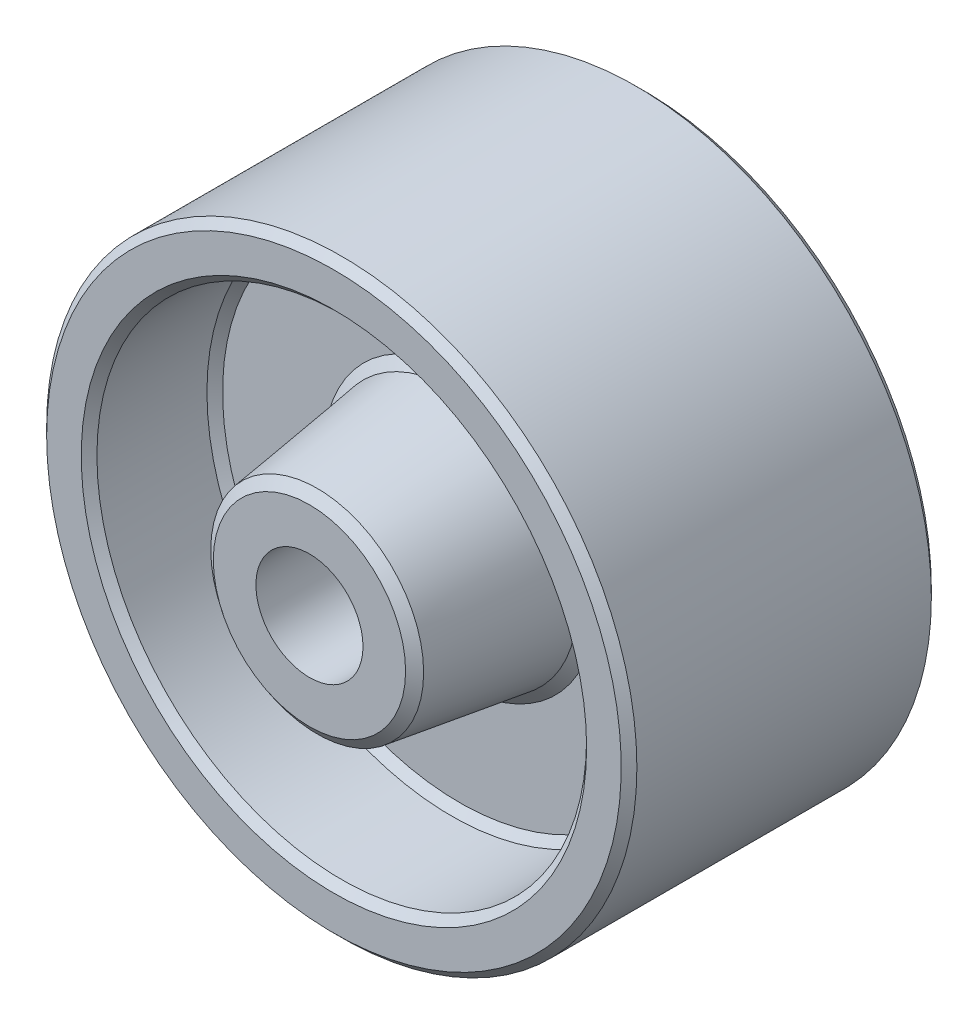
ISO-10303-21;
HEADER;
FILE_DESCRIPTION(('STEP AP214'),'2;1');
FILE_NAME('part.step','',(''),(''),'','','');
FILE_SCHEMA(('AUTOMOTIVE_DESIGN { 1 0 10303 214 1 1 1 1 }'));
ENDSEC;
DATA;
#1=APPLICATION_CONTEXT('core data for automotive mechanical design processes');
#2=APPLICATION_PROTOCOL_DEFINITION('international standard','automotive_design',2000,#1);
#3=PRODUCT_CONTEXT('',#1,'mechanical');
#4=PRODUCT('Part','Part','',(#3));
#5=PRODUCT_RELATED_PRODUCT_CATEGORY('part','',(#4));
#6=PRODUCT_DEFINITION_FORMATION('','',#4);
#7=PRODUCT_DEFINITION_CONTEXT('part definition',#1,'design');
#8=PRODUCT_DEFINITION('design','',#6,#7);
#9=PRODUCT_DEFINITION_SHAPE('','',#8);
#10=(LENGTH_UNIT() NAMED_UNIT(*) SI_UNIT(.MILLI.,.METRE.));
#11=(NAMED_UNIT(*) PLANE_ANGLE_UNIT() SI_UNIT($,.RADIAN.));
#12=(NAMED_UNIT(*) SI_UNIT($,.STERADIAN.) SOLID_ANGLE_UNIT());
#13=UNCERTAINTY_MEASURE_WITH_UNIT(LENGTH_MEASURE(1.E-05),#10,'distance_accuracy_value','');
#14=(GEOMETRIC_REPRESENTATION_CONTEXT(3) GLOBAL_UNCERTAINTY_ASSIGNED_CONTEXT((#13)) GLOBAL_UNIT_ASSIGNED_CONTEXT((#10,
#11,#12)) REPRESENTATION_CONTEXT('',''));
#15=CARTESIAN_POINT('',(0.,0.,0.));
#16=DIRECTION('',(0.,0.,1.));
#17=DIRECTION('',(1.,0.,0.));
#18=AXIS2_PLACEMENT_3D('',#15,#16,#17);
#19=CARTESIAN_POINT('',(0.,0.,2.8575));
#20=DIRECTION('',(0.,0.,1.));
#21=DIRECTION('',(1.,0.,0.));
#22=AXIS2_PLACEMENT_3D('',#19,#20,#21);
#23=PLANE('',#22);
#24=CARTESIAN_POINT('',(0.,0.,2.8575));
#25=DIRECTION('',(0.,0.,1.));
#26=DIRECTION('',(1.,0.,0.));
#27=AXIS2_PLACEMENT_3D('',#24,#25,#26);
#28=CIRCLE('',#27,23.0505);
#29=CARTESIAN_POINT('',(23.0505,0.,2.8575));
#30=VERTEX_POINT('',#29);
#31=EDGE_CURVE('E70',#30,#30,#28,.T.);
#32=ORIENTED_EDGE('',*,*,#31,.T.);
#33=EDGE_LOOP('',(#32));
#34=FACE_BOUND('',#33,.T.);
#35=CARTESIAN_POINT('',(0.,0.,2.8575));
#36=DIRECTION('',(0.,0.,1.));
#37=DIRECTION('',(1.,0.,0.));
#38=AXIS2_PLACEMENT_3D('',#35,#36,#37);
#39=CIRCLE('',#38,13.1937218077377);
#40=CARTESIAN_POINT('',(13.1937218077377,0.,2.8575));
#41=VERTEX_POINT('',#40);
#42=EDGE_CURVE('E73',#41,#41,#39,.F.);
#43=ORIENTED_EDGE('',*,*,#42,.T.);
#44=EDGE_LOOP('',(#43));
#45=FACE_BOUND('',#44,.T.);
#46=ADVANCED_FACE('F29',(#34,#45),#23,.T.);
#47=CARTESIAN_POINT('',(0.,0.,15.08125));
#48=DIRECTION('',(0.,0.,-1.));
#49=DIRECTION('',(-1.,0.,0.));
#50=AXIS2_PLACEMENT_3D('',#47,#48,#49);
#51=CYLINDRICAL_SURFACE('',#50,23.8125);
#52=CARTESIAN_POINT('',(0.,0.,-3.6195));
#53=DIRECTION('',(0.,0.,1.));
#54=DIRECTION('',(1.,0.,0.));
#55=AXIS2_PLACEMENT_3D('',#52,#53,#54);
#56=CIRCLE('',#55,23.8125);
#57=CARTESIAN_POINT('',(-23.8125,0.,-3.6195));
#58=VERTEX_POINT('',#57);
#59=EDGE_CURVE('E36',#58,#58,#56,.T.);
#60=CARTESIAN_POINT('',(0.,0.,-14.31925));
#61=DIRECTION('',(0.,0.,1.));
#62=DIRECTION('',(1.,0.,0.));
#63=AXIS2_PLACEMENT_3D('',#60,#61,#62);
#64=CIRCLE('',#63,23.8125);
#65=CARTESIAN_POINT('',(-23.8125,0.,-14.31925));
#66=VERTEX_POINT('',#65);
#67=EDGE_CURVE('E40',#66,#66,#64,.F.);
#68=CARTESIAN_POINT('',(-23.8125,0.,-3.6195));
#69=CARTESIAN_POINT('',(-23.8125,0.,-3.73095572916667));
#70=CARTESIAN_POINT('',(-23.8125,0.,-3.84241145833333));
#71=CARTESIAN_POINT('',(-23.8125,0.,-4.06532291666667));
#72=CARTESIAN_POINT('',(-23.8125,0.,-4.17677864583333));
#73=CARTESIAN_POINT('',(-23.8125,0.,-4.39969010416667));
#74=CARTESIAN_POINT('',(-23.8125,0.,-4.51114583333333));
#75=CARTESIAN_POINT('',(-23.8125,0.,-4.73405729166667));
#76=CARTESIAN_POINT('',(-23.8125,0.,-4.84551302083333));
#77=CARTESIAN_POINT('',(-23.8125,0.,-5.06842447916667));
#78=CARTESIAN_POINT('',(-23.8125,0.,-5.17988020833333));
#79=CARTESIAN_POINT('',(-23.8125,0.,-5.40279166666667));
#80=CARTESIAN_POINT('',(-23.8125,0.,-5.51424739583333));
#81=CARTESIAN_POINT('',(-23.8125,0.,-5.73715885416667));
#82=CARTESIAN_POINT('',(-23.8125,0.,-5.84861458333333));
#83=CARTESIAN_POINT('',(-23.8125,0.,-6.07152604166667));
#84=CARTESIAN_POINT('',(-23.8125,0.,-6.18298177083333));
#85=CARTESIAN_POINT('',(-23.8125,0.,-6.40589322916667));
#86=CARTESIAN_POINT('',(-23.8125,0.,-6.51734895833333));
#87=CARTESIAN_POINT('',(-23.8125,0.,-6.74026041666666));
#88=CARTESIAN_POINT('',(-23.8125,0.,-6.85171614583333));
#89=CARTESIAN_POINT('',(-23.8125,0.,-7.07462760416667));
#90=CARTESIAN_POINT('',(-23.8125,0.,-7.18608333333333));
#91=CARTESIAN_POINT('',(-23.8125,0.,-7.40899479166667));
#92=CARTESIAN_POINT('',(-23.8125,0.,-7.52045052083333));
#93=CARTESIAN_POINT('',(-23.8125,0.,-7.74336197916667));
#94=CARTESIAN_POINT('',(-23.8125,0.,-7.85481770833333));
#95=CARTESIAN_POINT('',(-23.8125,0.,-8.07772916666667));
#96=CARTESIAN_POINT('',(-23.8125,0.,-8.18918489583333));
#97=CARTESIAN_POINT('',(-23.8125,0.,-8.41209635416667));
#98=CARTESIAN_POINT('',(-23.8125,0.,-8.52355208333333));
#99=CARTESIAN_POINT('',(-23.8125,0.,-8.74646354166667));
#100=CARTESIAN_POINT('',(-23.8125,0.,-8.85791927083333));
#101=CARTESIAN_POINT('',(-23.8125,0.,-9.08083072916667));
#102=CARTESIAN_POINT('',(-23.8125,0.,-9.19228645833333));
#103=CARTESIAN_POINT('',(-23.8125,0.,-9.41519791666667));
#104=CARTESIAN_POINT('',(-23.8125,0.,-9.52665364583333));
#105=CARTESIAN_POINT('',(-23.8125,0.,-9.74956510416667));
#106=CARTESIAN_POINT('',(-23.8125,0.,-9.86102083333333));
#107=CARTESIAN_POINT('',(-23.8125,0.,-10.0839322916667));
#108=CARTESIAN_POINT('',(-23.8125,0.,-10.1953880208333));
#109=CARTESIAN_POINT('',(-23.8125,0.,-10.4182994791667));
#110=CARTESIAN_POINT('',(-23.8125,0.,-10.5297552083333));
#111=CARTESIAN_POINT('',(-23.8125,0.,-10.7526666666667));
#112=CARTESIAN_POINT('',(-23.8125,0.,-10.8641223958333));
#113=CARTESIAN_POINT('',(-23.8125,0.,-11.0870338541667));
#114=CARTESIAN_POINT('',(-23.8125,0.,-11.1984895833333));
#115=CARTESIAN_POINT('',(-23.8125,0.,-11.4214010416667));
#116=CARTESIAN_POINT('',(-23.8125,0.,-11.5328567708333));
#117=CARTESIAN_POINT('',(-23.8125,0.,-11.7557682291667));
#118=CARTESIAN_POINT('',(-23.8125,0.,-11.8672239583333));
#119=CARTESIAN_POINT('',(-23.8125,0.,-12.0901354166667));
#120=CARTESIAN_POINT('',(-23.8125,0.,-12.2015911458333));
#121=CARTESIAN_POINT('',(-23.8125,0.,-12.4245026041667));
#122=CARTESIAN_POINT('',(-23.8125,0.,-12.5359583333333));
#123=CARTESIAN_POINT('',(-23.8125,0.,-12.7588697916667));
#124=CARTESIAN_POINT('',(-23.8125,0.,-12.8703255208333));
#125=CARTESIAN_POINT('',(-23.8125,0.,-13.0932369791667));
#126=CARTESIAN_POINT('',(-23.8125,0.,-13.2046927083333));
#127=CARTESIAN_POINT('',(-23.8125,0.,-13.4276041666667));
#128=CARTESIAN_POINT('',(-23.8125,0.,-13.5390598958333));
#129=CARTESIAN_POINT('',(-23.8125,0.,-13.7619713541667));
#130=CARTESIAN_POINT('',(-23.8125,0.,-13.8734270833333));
#131=CARTESIAN_POINT('',(-23.8125,0.,-14.0963385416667));
#132=CARTESIAN_POINT('',(-23.8125,0.,-14.2077942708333));
#133=CARTESIAN_POINT('',(-23.8125,0.,-14.31925));
#134=B_SPLINE_CURVE_WITH_KNOTS('',3,(#68,#69,#70,#71,#72,#73,#74,#75,#76,#77,#78,#79,#80,#81,
#82,#83,#84,#85,#86,#87,#88,#89,#90,#91,#92,#93,#94,#95,#96,#97,#98,#99,#100,#101,#102,#103,
#104,#105,#106,#107,#108,#109,#110,#111,#112,#113,#114,#115,#116,#117,#118,#119,#120,#121,#122,
#123,#124,#125,#126,#127,#128,#129,#130,#131,#132,#133),.UNSPECIFIED.,.F.,.F.,(4,2,2,2,2,2,2,2,
2,2,2,2,2,2,2,2,2,2,2,2,2,2,2,2,2,2,2,2,2,2,2,2,4),(0.,0.3343671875,0.668734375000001,
1.0031015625,1.33746875,1.6718359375,2.006203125,2.3405703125,2.6749375,3.0093046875,
3.343671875,3.6780390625,4.01240625,4.3467734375,4.681140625,5.0155078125,5.349875,5.6842421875,
6.018609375,6.3529765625,6.68734375,7.0217109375,7.356078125,7.6904453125,8.0248125,
8.3591796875,8.693546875,9.0279140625,9.36228125,9.6966484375,10.031015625,10.3653828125,
10.69975),.UNSPECIFIED.);
#135=EDGE_CURVE('BSEAM124',#58,#66,#134,.T.);
#136=ORIENTED_EDGE('',*,*,#59,.T.);
#137=ORIENTED_EDGE('',*,*,#67,.T.);
#138=ORIENTED_EDGE('',*,*,#135,.T.);
#139=ORIENTED_EDGE('',*,*,#135,.F.);
#140=EDGE_LOOP('',(#136,#138,#137,#139));
#141=FACE_BOUND('',#140,.T.);
#142=ADVANCED_FACE('F124',(#141),#51,.F.);
#143=CARTESIAN_POINT('',(0.,0.,14.31925));
#144=DIRECTION('',(0.,0.,1.));
#145=DIRECTION('',(1.,0.,0.));
#146=AXIS2_PLACEMENT_3D('',#143,#144,#145);
#147=CIRCLE('',#146,23.8125);
#148=CARTESIAN_POINT('',(-23.8125,0.,14.31925));
#149=VERTEX_POINT('',#148);
#150=EDGE_CURVE('E79',#149,#149,#147,.T.);
#151=CARTESIAN_POINT('',(0.,0.,3.6195));
#152=DIRECTION('',(0.,0.,1.));
#153=DIRECTION('',(1.,0.,0.));
#154=AXIS2_PLACEMENT_3D('',#151,#152,#153);
#155=CIRCLE('',#154,23.8125);
#156=CARTESIAN_POINT('',(-23.8125,0.,3.6195));
#157=VERTEX_POINT('',#156);
#158=EDGE_CURVE('E82',#157,#157,#155,.F.);
#159=CARTESIAN_POINT('',(-23.8125,0.,14.31925));
#160=CARTESIAN_POINT('',(-23.8125,0.,14.2077942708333));
#161=CARTESIAN_POINT('',(-23.8125,0.,14.0963385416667));
#162=CARTESIAN_POINT('',(-23.8125,0.,13.8734270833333));
#163=CARTESIAN_POINT('',(-23.8125,0.,13.7619713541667));
#164=CARTESIAN_POINT('',(-23.8125,0.,13.5390598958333));
#165=CARTESIAN_POINT('',(-23.8125,0.,13.4276041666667));
#166=CARTESIAN_POINT('',(-23.8125,0.,13.2046927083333));
#167=CARTESIAN_POINT('',(-23.8125,0.,13.0932369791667));
#168=CARTESIAN_POINT('',(-23.8125,0.,12.8703255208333));
#169=CARTESIAN_POINT('',(-23.8125,0.,12.7588697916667));
#170=CARTESIAN_POINT('',(-23.8125,0.,12.5359583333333));
#171=CARTESIAN_POINT('',(-23.8125,0.,12.4245026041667));
#172=CARTESIAN_POINT('',(-23.8125,0.,12.2015911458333));
#173=CARTESIAN_POINT('',(-23.8125,0.,12.0901354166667));
#174=CARTESIAN_POINT('',(-23.8125,0.,11.8672239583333));
#175=CARTESIAN_POINT('',(-23.8125,0.,11.7557682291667));
#176=CARTESIAN_POINT('',(-23.8125,0.,11.5328567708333));
#177=CARTESIAN_POINT('',(-23.8125,0.,11.4214010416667));
#178=CARTESIAN_POINT('',(-23.8125,0.,11.1984895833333));
#179=CARTESIAN_POINT('',(-23.8125,0.,11.0870338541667));
#180=CARTESIAN_POINT('',(-23.8125,0.,10.8641223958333));
#181=CARTESIAN_POINT('',(-23.8125,0.,10.7526666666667));
#182=CARTESIAN_POINT('',(-23.8125,0.,10.5297552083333));
#183=CARTESIAN_POINT('',(-23.8125,0.,10.4182994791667));
#184=CARTESIAN_POINT('',(-23.8125,0.,10.1953880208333));
#185=CARTESIAN_POINT('',(-23.8125,0.,10.0839322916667));
#186=CARTESIAN_POINT('',(-23.8125,0.,9.86102083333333));
#187=CARTESIAN_POINT('',(-23.8125,0.,9.74956510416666));
#188=CARTESIAN_POINT('',(-23.8125,0.,9.52665364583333));
#189=CARTESIAN_POINT('',(-23.8125,0.,9.41519791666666));
#190=CARTESIAN_POINT('',(-23.8125,0.,9.19228645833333));
#191=CARTESIAN_POINT('',(-23.8125,0.,9.08083072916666));
#192=CARTESIAN_POINT('',(-23.8125,0.,8.85791927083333));
#193=CARTESIAN_POINT('',(-23.8125,0.,8.74646354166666));
#194=CARTESIAN_POINT('',(-23.8125,0.,8.52355208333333));
#195=CARTESIAN_POINT('',(-23.8125,0.,8.41209635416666));
#196=CARTESIAN_POINT('',(-23.8125,0.,8.18918489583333));
#197=CARTESIAN_POINT('',(-23.8125,0.,8.07772916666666));
#198=CARTESIAN_POINT('',(-23.8125,0.,7.85481770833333));
#199=CARTESIAN_POINT('',(-23.8125,0.,7.74336197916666));
#200=CARTESIAN_POINT('',(-23.8125,0.,7.52045052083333));
#201=CARTESIAN_POINT('',(-23.8125,0.,7.40899479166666));
#202=CARTESIAN_POINT('',(-23.8125,0.,7.18608333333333));
#203=CARTESIAN_POINT('',(-23.8125,0.,7.07462760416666));
#204=CARTESIAN_POINT('',(-23.8125,0.,6.85171614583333));
#205=CARTESIAN_POINT('',(-23.8125,0.,6.74026041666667));
#206=CARTESIAN_POINT('',(-23.8125,0.,6.51734895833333));
#207=CARTESIAN_POINT('',(-23.8125,0.,6.40589322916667));
#208=CARTESIAN_POINT('',(-23.8125,0.,6.18298177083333));
#209=CARTESIAN_POINT('',(-23.8125,0.,6.07152604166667));
#210=CARTESIAN_POINT('',(-23.8125,0.,5.84861458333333));
#211=CARTESIAN_POINT('',(-23.8125,0.,5.73715885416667));
#212=CARTESIAN_POINT('',(-23.8125,0.,5.51424739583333));
#213=CARTESIAN_POINT('',(-23.8125,0.,5.40279166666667));
#214=CARTESIAN_POINT('',(-23.8125,0.,5.17988020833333));
#215=CARTESIAN_POINT('',(-23.8125,0.,5.06842447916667));
#216=CARTESIAN_POINT('',(-23.8125,0.,4.84551302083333));
#217=CARTESIAN_POINT('',(-23.8125,0.,4.73405729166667));
#218=CARTESIAN_POINT('',(-23.8125,0.,4.51114583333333));
#219=CARTESIAN_POINT('',(-23.8125,0.,4.39969010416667));
#220=CARTESIAN_POINT('',(-23.8125,0.,4.17677864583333));
#221=CARTESIAN_POINT('',(-23.8125,0.,4.06532291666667));
#222=CARTESIAN_POINT('',(-23.8125,0.,3.84241145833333));
#223=CARTESIAN_POINT('',(-23.8125,0.,3.73095572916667));
#224=CARTESIAN_POINT('',(-23.8125,0.,3.6195));
#225=B_SPLINE_CURVE_WITH_KNOTS('',3,(#159,#160,#161,#162,#163,#164,#165,#166,#167,#168,#169,
#170,#171,#172,#173,#174,#175,#176,#177,#178,#179,#180,#181,#182,#183,#184,#185,#186,#187,#188,
#189,#190,#191,#192,#193,#194,#195,#196,#197,#198,#199,#200,#201,#202,#203,#204,#205,#206,#207,
#208,#209,#210,#211,#212,#213,#214,#215,#216,#217,#218,#219,#220,#221,#222,#223,#224),
.UNSPECIFIED.,.F.,.F.,(4,2,2,2,2,2,2,2,2,2,2,2,2,2,2,2,2,2,2,2,2,2,2,2,2,2,2,2,2,2,2,2,4),(0.,
0.3343671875,0.668734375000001,1.0031015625,1.33746875,1.6718359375,2.006203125,2.3405703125,
2.6749375,3.0093046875,3.343671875,3.6780390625,4.01240625,4.3467734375,4.681140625,
5.0155078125,5.349875,5.6842421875,6.018609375,6.3529765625,6.68734375,7.0217109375,7.356078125,
7.69044531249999,8.02481249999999,8.35917968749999,8.69354687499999,9.02791406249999,9.36228125,
9.6966484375,10.031015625,10.3653828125,10.69975),.UNSPECIFIED.);
#226=EDGE_CURVE('BSEAM31',#149,#157,#225,.T.);
#227=ORIENTED_EDGE('',*,*,#150,.T.);
#228=ORIENTED_EDGE('',*,*,#158,.T.);
#229=ORIENTED_EDGE('',*,*,#226,.T.);
#230=ORIENTED_EDGE('',*,*,#226,.F.);
#231=EDGE_LOOP('',(#227,#229,#228,#230));
#232=FACE_BOUND('',#231,.T.);
#233=ADVANCED_FACE('F31',(#232),#51,.F.);
#234=CARTESIAN_POINT('',(0.,0.,15.08125));
#235=DIRECTION('',(0.,0.,-1.));
#236=DIRECTION('',(-1.,0.,0.));
#237=AXIS2_PLACEMENT_3D('',#234,#235,#236);
#238=CYLINDRICAL_SURFACE('',#237,28.702);
#239=CARTESIAN_POINT('',(0.,0.,14.31925));
#240=DIRECTION('',(0.,0.,1.));
#241=DIRECTION('',(1.,0.,0.));
#242=AXIS2_PLACEMENT_3D('',#239,#240,#241);
#243=CIRCLE('',#242,28.702);
#244=CARTESIAN_POINT('',(-28.702,0.,14.31925));
#245=VERTEX_POINT('',#244);
#246=EDGE_CURVE('E88',#245,#245,#243,.F.);
#247=CARTESIAN_POINT('',(0.,0.,-14.31925));
#248=DIRECTION('',(0.,0.,1.));
#249=DIRECTION('',(1.,0.,0.));
#250=AXIS2_PLACEMENT_3D('',#247,#248,#249);
#251=CIRCLE('',#250,28.702);
#252=CARTESIAN_POINT('',(-28.702,0.,-14.31925));
#253=VERTEX_POINT('',#252);
#254=EDGE_CURVE('E91',#253,#253,#251,.T.);
#255=CARTESIAN_POINT('',(-28.702,0.,14.31925));
#256=CARTESIAN_POINT('',(-28.702,0.,14.0209322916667));
#257=CARTESIAN_POINT('',(-28.702,0.,13.7226145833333));
#258=CARTESIAN_POINT('',(-28.702,0.,13.1259791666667));
#259=CARTESIAN_POINT('',(-28.702,0.,12.8276614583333));
#260=CARTESIAN_POINT('',(-28.702,0.,12.2310260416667));
#261=CARTESIAN_POINT('',(-28.702,0.,11.9327083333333));
#262=CARTESIAN_POINT('',(-28.702,0.,11.3360729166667));
#263=CARTESIAN_POINT('',(-28.702,0.,11.0377552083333));
#264=CARTESIAN_POINT('',(-28.702,0.,10.4411197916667));
#265=CARTESIAN_POINT('',(-28.702,0.,10.1428020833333));
#266=CARTESIAN_POINT('',(-28.702,0.,9.54616666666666));
#267=CARTESIAN_POINT('',(-28.702,0.,9.24784895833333));
#268=CARTESIAN_POINT('',(-28.702,0.,8.65121354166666));
#269=CARTESIAN_POINT('',(-28.702,0.,8.35289583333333));
#270=CARTESIAN_POINT('',(-28.702,0.,7.75626041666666));
#271=CARTESIAN_POINT('',(-28.702,0.,7.45794270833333));
#272=CARTESIAN_POINT('',(-28.702,0.,6.86130729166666));
#273=CARTESIAN_POINT('',(-28.702,0.,6.56298958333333));
#274=CARTESIAN_POINT('',(-28.702,0.,5.96635416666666));
#275=CARTESIAN_POINT('',(-28.702,0.,5.66803645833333));
#276=CARTESIAN_POINT('',(-28.702,0.,5.07140104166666));
#277=CARTESIAN_POINT('',(-28.702,0.,4.77308333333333));
#278=CARTESIAN_POINT('',(-28.702,0.,4.17644791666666));
#279=CARTESIAN_POINT('',(-28.702,0.,3.87813020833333));
#280=CARTESIAN_POINT('',(-28.702,0.,3.28149479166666));
#281=CARTESIAN_POINT('',(-28.702,0.,2.98317708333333));
#282=CARTESIAN_POINT('',(-28.702,0.,2.38654166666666));
#283=CARTESIAN_POINT('',(-28.702,0.,2.08822395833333));
#284=CARTESIAN_POINT('',(-28.702,0.,1.49158854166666));
#285=CARTESIAN_POINT('',(-28.702,0.,1.19327083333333));
#286=CARTESIAN_POINT('',(-28.702,0.,0.596635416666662));
#287=CARTESIAN_POINT('',(-28.702,0.,0.298317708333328));
#288=CARTESIAN_POINT('',(-28.702,0.,-0.298317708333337));
#289=CARTESIAN_POINT('',(-28.702,0.,-0.59663541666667));
#290=CARTESIAN_POINT('',(-28.702,0.,-1.19327083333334));
#291=CARTESIAN_POINT('',(-28.702,0.,-1.49158854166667));
#292=CARTESIAN_POINT('',(-28.702,0.,-2.08822395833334));
#293=CARTESIAN_POINT('',(-28.702,0.,-2.38654166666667));
#294=CARTESIAN_POINT('',(-28.702,0.,-2.98317708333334));
#295=CARTESIAN_POINT('',(-28.702,0.,-3.28149479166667));
#296=CARTESIAN_POINT('',(-28.702,0.,-3.87813020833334));
#297=CARTESIAN_POINT('',(-28.702,0.,-4.17644791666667));
#298=CARTESIAN_POINT('',(-28.702,0.,-4.77308333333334));
#299=CARTESIAN_POINT('',(-28.702,0.,-5.07140104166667));
#300=CARTESIAN_POINT('',(-28.702,0.,-5.66803645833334));
#301=CARTESIAN_POINT('',(-28.702,0.,-5.96635416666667));
#302=CARTESIAN_POINT('',(-28.702,0.,-6.56298958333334));
#303=CARTESIAN_POINT('',(-28.702,0.,-6.86130729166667));
#304=CARTESIAN_POINT('',(-28.702,0.,-7.45794270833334));
#305=CARTESIAN_POINT('',(-28.702,0.,-7.75626041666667));
#306=CARTESIAN_POINT('',(-28.702,0.,-8.35289583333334));
#307=CARTESIAN_POINT('',(-28.702,0.,-8.65121354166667));
#308=CARTESIAN_POINT('',(-28.702,0.,-9.24784895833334));
#309=CARTESIAN_POINT('',(-28.702,0.,-9.54616666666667));
#310=CARTESIAN_POINT('',(-28.702,0.,-10.1428020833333));
#311=CARTESIAN_POINT('',(-28.702,0.,-10.4411197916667));
#312=CARTESIAN_POINT('',(-28.702,0.,-11.0377552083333));
#313=CARTESIAN_POINT('',(-28.702,0.,-11.3360729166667));
#314=CARTESIAN_POINT('',(-28.702,0.,-11.9327083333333));
#315=CARTESIAN_POINT('',(-28.702,0.,-12.2310260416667));
#316=CARTESIAN_POINT('',(-28.702,0.,-12.8276614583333));
#317=CARTESIAN_POINT('',(-28.702,0.,-13.1259791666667));
#318=CARTESIAN_POINT('',(-28.702,0.,-13.7226145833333));
#319=CARTESIAN_POINT('',(-28.702,0.,-14.0209322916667));
#320=CARTESIAN_POINT('',(-28.702,0.,-14.31925));
#321=B_SPLINE_CURVE_WITH_KNOTS('',3,(#255,#256,#257,#258,#259,#260,#261,#262,#263,#264,#265,
#266,#267,#268,#269,#270,#271,#272,#273,#274,#275,#276,#277,#278,#279,#280,#281,#282,#283,#284,
#285,#286,#287,#288,#289,#290,#291,#292,#293,#294,#295,#296,#297,#298,#299,#300,#301,#302,#303,
#304,#305,#306,#307,#308,#309,#310,#311,#312,#313,#314,#315,#316,#317,#318,#319,#320),
.UNSPECIFIED.,.F.,.F.,(4,2,2,2,2,2,2,2,2,2,2,2,2,2,2,2,2,2,2,2,2,2,2,2,2,2,2,2,2,2,2,2,4),(0.,
0.894953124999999,1.78990625,2.684859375,3.5798125,4.474765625,5.36971875,6.264671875,7.159625,
8.054578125,8.94953125,9.844484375,10.7394375,11.634390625,12.52934375,13.424296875,14.31925,
15.214203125,16.10915625,17.004109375,17.8990625,18.794015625,19.68896875,20.583921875,
21.478875,22.373828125,23.26878125,24.163734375,25.0586875,25.953640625,26.84859375,
27.743546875,28.6385),.UNSPECIFIED.);
#322=EDGE_CURVE('BSEAM136',#245,#253,#321,.T.);
#323=ORIENTED_EDGE('',*,*,#246,.T.);
#324=ORIENTED_EDGE('',*,*,#254,.T.);
#325=ORIENTED_EDGE('',*,*,#322,.T.);
#326=ORIENTED_EDGE('',*,*,#322,.F.);
#327=EDGE_LOOP('',(#323,#325,#324,#326));
#328=FACE_BOUND('',#327,.T.);
#329=ADVANCED_FACE('F136',(#328),#238,.T.);
#330=CARTESIAN_POINT('',(0.,-63.2858213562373,15.08125));
#331=DIRECTION('',(0.,0.,1.));
#332=DIRECTION('',(1.,0.,0.));
#333=AXIS2_PLACEMENT_3D('',#330,#331,#332);
#334=PLANE('',#333);
#335=CARTESIAN_POINT('',(0.,0.,15.08125));
#336=DIRECTION('',(0.,0.,1.));
#337=DIRECTION('',(1.,0.,0.));
#338=AXIS2_PLACEMENT_3D('',#335,#336,#337);
#339=CIRCLE('',#338,24.5745);
#340=CARTESIAN_POINT('',(24.5745,0.,15.08125));
#341=VERTEX_POINT('',#340);
#342=EDGE_CURVE('E76',#341,#341,#339,.F.);
#343=ORIENTED_EDGE('',*,*,#342,.T.);
#344=EDGE_LOOP('',(#343));
#345=FACE_BOUND('',#344,.T.);
#346=CARTESIAN_POINT('',(0.,0.,15.08125));
#347=DIRECTION('',(0.,0.,1.));
#348=DIRECTION('',(1.,0.,0.));
#349=AXIS2_PLACEMENT_3D('',#346,#347,#348);
#350=CIRCLE('',#349,27.94);
#351=CARTESIAN_POINT('',(-27.94,0.,15.08125));
#352=VERTEX_POINT('',#351);
#353=EDGE_CURVE('E94',#352,#352,#350,.T.);
#354=ORIENTED_EDGE('',*,*,#353,.T.);
#355=EDGE_LOOP('',(#354));
#356=FACE_BOUND('',#355,.T.);
#357=ADVANCED_FACE('F134',(#345,#356),#334,.T.);
#358=CARTESIAN_POINT('',(0.,-63.2858213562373,-15.08125));
#359=DIRECTION('',(0.,0.,1.));
#360=DIRECTION('',(1.,0.,0.));
#361=AXIS2_PLACEMENT_3D('',#358,#359,#360);
#362=PLANE('',#361);
#363=CARTESIAN_POINT('',(0.,0.,-15.08125));
#364=DIRECTION('',(0.,0.,1.));
#365=DIRECTION('',(1.,0.,0.));
#366=AXIS2_PLACEMENT_3D('',#363,#364,#365);
#367=CIRCLE('',#366,24.5745);
#368=CARTESIAN_POINT('',(24.5745,0.,-15.08125));
#369=VERTEX_POINT('',#368);
#370=EDGE_CURVE('E10',#369,#369,#367,.T.);
#371=ORIENTED_EDGE('',*,*,#370,.T.);
#372=EDGE_LOOP('',(#371));
#373=FACE_BOUND('',#372,.T.);
#374=CARTESIAN_POINT('',(0.,0.,-15.08125));
#375=DIRECTION('',(0.,0.,1.));
#376=DIRECTION('',(1.,0.,0.));
#377=AXIS2_PLACEMENT_3D('',#374,#375,#376);
#378=CIRCLE('',#377,27.94);
#379=CARTESIAN_POINT('',(27.94,0.,-15.08125));
#380=VERTEX_POINT('',#379);
#381=EDGE_CURVE('E85',#380,#380,#378,.F.);
#382=ORIENTED_EDGE('',*,*,#381,.T.);
#383=EDGE_LOOP('',(#382));
#384=FACE_BOUND('',#383,.T.);
#385=ADVANCED_FACE('F119',(#373,#384),#362,.F.);
#386=CARTESIAN_POINT('',(0.,0.,-2.8575));
#387=DIRECTION('',(0.,0.,1.));
#388=DIRECTION('',(1.,0.,0.));
#389=AXIS2_PLACEMENT_3D('',#386,#387,#388);
#390=PLANE('',#389);
#391=CARTESIAN_POINT('',(0.,0.,-2.8575));
#392=DIRECTION('',(0.,0.,1.));
#393=DIRECTION('',(1.,0.,0.));
#394=AXIS2_PLACEMENT_3D('',#391,#392,#393);
#395=CIRCLE('',#394,12.9608010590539);
#396=CARTESIAN_POINT('',(12.9608010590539,0.,-2.8575));
#397=VERTEX_POINT('',#396);
#398=EDGE_CURVE('E55',#397,#397,#395,.T.);
#399=ORIENTED_EDGE('',*,*,#398,.T.);
#400=EDGE_LOOP('',(#399));
#401=FACE_BOUND('',#400,.T.);
#402=CARTESIAN_POINT('',(0.,0.,-2.8575));
#403=DIRECTION('',(0.,0.,1.));
#404=DIRECTION('',(1.,0.,0.));
#405=AXIS2_PLACEMENT_3D('',#402,#403,#404);
#406=CIRCLE('',#405,23.0505);
#407=CARTESIAN_POINT('',(23.0505,0.,-2.8575));
#408=VERTEX_POINT('',#407);
#409=EDGE_CURVE('E58',#408,#408,#406,.F.);
#410=ORIENTED_EDGE('',*,*,#409,.T.);
#411=EDGE_LOOP('',(#410));
#412=FACE_BOUND('',#411,.T.);
#413=ADVANCED_FACE('F109',(#401,#412),#390,.F.);
#414=CARTESIAN_POINT('',(0.,0.,17.4625));
#415=DIRECTION('',(0.,0.,1.));
#416=DIRECTION('',(1.,0.,0.));
#417=AXIS2_PLACEMENT_3D('',#414,#415,#416);
#418=PLANE('',#417);
#419=CARTESIAN_POINT('',(0.,0.,17.4625));
#420=DIRECTION('',(0.,0.,1.));
#421=DIRECTION('',(1.,0.,0.));
#422=AXIS2_PLACEMENT_3D('',#419,#420,#421);
#423=CIRCLE('',#422,9.35048843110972);
#424=CARTESIAN_POINT('',(9.35048843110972,0.,17.4625));
#425=VERTEX_POINT('',#424);
#426=EDGE_CURVE('E61',#425,#425,#423,.T.);
#427=ORIENTED_EDGE('',*,*,#426,.T.);
#428=EDGE_LOOP('',(#427));
#429=FACE_BOUND('',#428,.T.);
#430=CARTESIAN_POINT('',(0.,0.,17.4625));
#431=DIRECTION('',(0.,0.,1.));
#432=DIRECTION('',(1.,0.,0.));
#433=AXIS2_PLACEMENT_3D('',#430,#431,#432);
#434=CIRCLE('',#433,5.207);
#435=CARTESIAN_POINT('',(5.207,0.,17.4625));
#436=VERTEX_POINT('',#435);
#437=EDGE_CURVE('E100',#436,#436,#434,.T.);
#438=ORIENTED_EDGE('',*,*,#437,.F.);
#439=EDGE_LOOP('',(#438));
#440=FACE_BOUND('',#439,.T.);
#441=ADVANCED_FACE('F106',(#429,#440),#418,.T.);
#442=CARTESIAN_POINT('',(0.,0.,0.));
#443=DIRECTION('',(0.,0.,-1.));
#444=DIRECTION('',(1.,0.,0.));
#445=AXIS2_PLACEMENT_3D('',#442,#443,#444);
#446=CONICAL_SURFACE('',#445,12.7,0.139626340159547);
#447=CARTESIAN_POINT('',(0.,0.,3.61208426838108));
#448=DIRECTION('',(0.,0.,1.));
#449=DIRECTION('',(1.,0.,0.));
#450=AXIS2_PLACEMENT_3D('',#447,#448,#449);
#451=CIRCLE('',#450,12.1923546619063);
#452=CARTESIAN_POINT('',(12.1923546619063,0.,3.61208426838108));
#453=VERTEX_POINT('',#452);
#454=EDGE_CURVE('E64',#453,#453,#451,.T.);
#455=ORIENTED_EDGE('',*,*,#454,.T.);
#456=EDGE_LOOP('',(#455));
#457=FACE_BOUND('',#456,.T.);
#458=CARTESIAN_POINT('',(0.,0.,16.7079157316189));
#459=DIRECTION('',(0.,0.,-1.));
#460=DIRECTION('',(-1.,0.,0.));
#461=AXIS2_PLACEMENT_3D('',#458,#459,#460);
#462=CIRCLE('',#461,10.3518555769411);
#463=CARTESIAN_POINT('',(-10.3518555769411,0.,16.7079157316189));
#464=VERTEX_POINT('',#463);
#465=EDGE_CURVE('E67',#464,#464,#462,.T.);
#466=ORIENTED_EDGE('',*,*,#465,.T.);
#467=EDGE_LOOP('',(#466));
#468=FACE_BOUND('',#467,.T.);
#469=ADVANCED_FACE('F108',(#457,#468),#446,.T.);
#470=CARTESIAN_POINT('',(0.,0.,0.));
#471=DIRECTION('',(0.,0.,1.));
#472=DIRECTION('',(1.,0.,0.));
#473=AXIS2_PLACEMENT_3D('',#470,#471,#472);
#474=CONICAL_SURFACE('',#473,12.7,0.139626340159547);
#475=CARTESIAN_POINT('',(0.,0.,-3.51345009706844));
#476=DIRECTION('',(0.,0.,-1.));
#477=DIRECTION('',(-1.,0.,0.));
#478=AXIS2_PLACEMENT_3D('',#475,#476,#477);
#479=CIRCLE('',#478,12.2062167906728);
#480=CARTESIAN_POINT('',(-12.2062167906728,0.,-3.51345009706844));
#481=VERTEX_POINT('',#480);
#482=EDGE_CURVE('E49',#481,#481,#479,.T.);
#483=ORIENTED_EDGE('',*,*,#482,.T.);
#484=EDGE_LOOP('',(#483));
#485=FACE_BOUND('',#484,.T.);
#486=CARTESIAN_POINT('',(0.,0.,-16.8065499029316));
#487=DIRECTION('',(0.,0.,1.));
#488=DIRECTION('',(1.,0.,0.));
#489=AXIS2_PLACEMENT_3D('',#486,#487,#488);
#490=CIRCLE('',#489,10.3379934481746);
#491=CARTESIAN_POINT('',(10.3379934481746,0.,-16.8065499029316));
#492=VERTEX_POINT('',#491);
#493=EDGE_CURVE('E52',#492,#492,#490,.T.);
#494=ORIENTED_EDGE('',*,*,#493,.T.);
#495=EDGE_LOOP('',(#494));
#496=FACE_BOUND('',#495,.T.);
#497=ADVANCED_FACE('F116',(#485,#496),#474,.T.);
#498=CARTESIAN_POINT('',(0.,0.,-17.4625));
#499=DIRECTION('',(0.,0.,1.));
#500=DIRECTION('',(1.,0.,0.));
#501=AXIS2_PLACEMENT_3D('',#498,#499,#500);
#502=PLANE('',#501);
#503=CARTESIAN_POINT('',(0.,0.,-17.4625));
#504=DIRECTION('',(0.,0.,1.));
#505=DIRECTION('',(1.,0.,0.));
#506=AXIS2_PLACEMENT_3D('',#503,#504,#505);
#507=CIRCLE('',#506,9.58340917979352);
#508=CARTESIAN_POINT('',(9.58340917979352,0.,-17.4625));
#509=VERTEX_POINT('',#508);
#510=EDGE_CURVE('E44',#509,#509,#507,.F.);
#511=ORIENTED_EDGE('',*,*,#510,.T.);
#512=EDGE_LOOP('',(#511));
#513=FACE_BOUND('',#512,.T.);
#514=CARTESIAN_POINT('',(0.,0.,-17.4625));
#515=DIRECTION('',(0.,0.,1.));
#516=DIRECTION('',(1.,0.,0.));
#517=AXIS2_PLACEMENT_3D('',#514,#515,#516);
#518=CIRCLE('',#517,5.207);
#519=CARTESIAN_POINT('',(5.207,0.,-17.4625));
#520=VERTEX_POINT('',#519);
#521=EDGE_CURVE('E97',#520,#520,#518,.T.);
#522=ORIENTED_EDGE('',*,*,#521,.T.);
#523=EDGE_LOOP('',(#522));
#524=FACE_BOUND('',#523,.T.);
#525=ADVANCED_FACE('F168',(#513,#524),#502,.F.);
#526=CARTESIAN_POINT('',(0.,0.,-17.4625));
#527=DIRECTION('',(0.,0.,1.));
#528=DIRECTION('',(1.,0.,0.));
#529=AXIS2_PLACEMENT_3D('',#526,#527,#528);
#530=CYLINDRICAL_SURFACE('',#529,5.207);
#531=ORIENTED_EDGE('',*,*,#521,.F.);
#532=EDGE_LOOP('',(#531));
#533=FACE_BOUND('',#532,.T.);
#534=ORIENTED_EDGE('',*,*,#437,.T.);
#535=EDGE_LOOP('',(#534));
#536=FACE_BOUND('',#535,.T.);
#537=ADVANCED_FACE('F104',(#533,#536),#530,.F.);
#538=CARTESIAN_POINT('',(0.,0.,15.08125));
#539=DIRECTION('',(0.,0.,-1.));
#540=DIRECTION('',(-1.,0.,0.));
#541=AXIS2_PLACEMENT_3D('',#538,#539,#540);
#542=CONICAL_SURFACE('',#541,27.94,0.785398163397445);
#543=CARTESIAN_POINT('',(-28.702,0.,14.31925));
#544=CARTESIAN_POINT('',(-28.6940625,0.,14.3271875));
#545=CARTESIAN_POINT('',(-28.686125,0.,14.335125));
#546=CARTESIAN_POINT('',(-28.67025,0.,14.351));
#547=CARTESIAN_POINT('',(-28.6623125,0.,14.3589375));
#548=CARTESIAN_POINT('',(-28.6464375,0.,14.3748125));
#549=CARTESIAN_POINT('',(-28.6385,0.,14.38275));
#550=CARTESIAN_POINT('',(-28.622625,0.,14.398625));
#551=CARTESIAN_POINT('',(-28.6146875,0.,14.4065625));
#552=CARTESIAN_POINT('',(-28.5988125,0.,14.4224375));
#553=CARTESIAN_POINT('',(-28.590875,0.,14.430375));
#554=CARTESIAN_POINT('',(-28.575,0.,14.44625));
#555=CARTESIAN_POINT('',(-28.5670625,0.,14.4541875));
#556=CARTESIAN_POINT('',(-28.5511875,0.,14.4700625));
#557=CARTESIAN_POINT('',(-28.54325,0.,14.478));
#558=CARTESIAN_POINT('',(-28.527375,0.,14.493875));
#559=CARTESIAN_POINT('',(-28.5194375,0.,14.5018125));
#560=CARTESIAN_POINT('',(-28.5035625,0.,14.5176875));
#561=CARTESIAN_POINT('',(-28.495625,0.,14.525625));
#562=CARTESIAN_POINT('',(-28.47975,0.,14.5415));
#563=CARTESIAN_POINT('',(-28.4718125,0.,14.5494375));
#564=CARTESIAN_POINT('',(-28.4559375,0.,14.5653125));
#565=CARTESIAN_POINT('',(-28.448,0.,14.57325));
#566=CARTESIAN_POINT('',(-28.432125,0.,14.589125));
#567=CARTESIAN_POINT('',(-28.4241875,0.,14.5970625));
#568=CARTESIAN_POINT('',(-28.4083125,0.,14.6129375));
#569=CARTESIAN_POINT('',(-28.400375,0.,14.620875));
#570=CARTESIAN_POINT('',(-28.3845,0.,14.63675));
#571=CARTESIAN_POINT('',(-28.3765625,0.,14.6446875));
#572=CARTESIAN_POINT('',(-28.3606875,0.,14.6605625));
#573=CARTESIAN_POINT('',(-28.35275,0.,14.6685));
#574=CARTESIAN_POINT('',(-28.336875,0.,14.684375));
#575=CARTESIAN_POINT('',(-28.3289375,0.,14.6923125));
#576=CARTESIAN_POINT('',(-28.3130625,0.,14.7081875));
#577=CARTESIAN_POINT('',(-28.305125,0.,14.716125));
#578=CARTESIAN_POINT('',(-28.28925,0.,14.732));
#579=CARTESIAN_POINT('',(-28.2813125,0.,14.7399375));
#580=CARTESIAN_POINT('',(-28.2654375,0.,14.7558125));
#581=CARTESIAN_POINT('',(-28.2575,0.,14.76375));
#582=CARTESIAN_POINT('',(-28.241625,0.,14.779625));
#583=CARTESIAN_POINT('',(-28.2336875,0.,14.7875625));
#584=CARTESIAN_POINT('',(-28.2178125,0.,14.8034375));
#585=CARTESIAN_POINT('',(-28.209875,0.,14.811375));
#586=CARTESIAN_POINT('',(-28.194,0.,14.82725));
#587=CARTESIAN_POINT('',(-28.1860625,0.,14.8351875));
#588=CARTESIAN_POINT('',(-28.1701875,0.,14.8510625));
#589=CARTESIAN_POINT('',(-28.16225,0.,14.859));
#590=CARTESIAN_POINT('',(-28.146375,0.,14.874875));
#591=CARTESIAN_POINT('',(-28.1384375,0.,14.8828125));
#592=CARTESIAN_POINT('',(-28.1225625,0.,14.8986875));
#593=CARTESIAN_POINT('',(-28.114625,0.,14.906625));
#594=CARTESIAN_POINT('',(-28.09875,0.,14.9225));
#595=CARTESIAN_POINT('',(-28.0908125,0.,14.9304375));
#596=CARTESIAN_POINT('',(-28.0749375,0.,14.9463125));
#597=CARTESIAN_POINT('',(-28.067,0.,14.95425));
#598=CARTESIAN_POINT('',(-28.051125,0.,14.970125));
#599=CARTESIAN_POINT('',(-28.0431875,0.,14.9780625));
#600=CARTESIAN_POINT('',(-28.0273125,0.,14.9939375));
#601=CARTESIAN_POINT('',(-28.019375,0.,15.001875));
#602=CARTESIAN_POINT('',(-28.0035,0.,15.01775));
#603=CARTESIAN_POINT('',(-27.9955625,0.,15.0256875));
#604=CARTESIAN_POINT('',(-27.9796875,0.,15.0415625));
#605=CARTESIAN_POINT('',(-27.97175,0.,15.0495));
#606=CARTESIAN_POINT('',(-27.955875,0.,15.065375));
#607=CARTESIAN_POINT('',(-27.9479375,0.,15.0733125));
#608=CARTESIAN_POINT('',(-27.94,0.,15.08125));
#609=B_SPLINE_CURVE_WITH_KNOTS('',3,(#543,#544,#545,#546,#547,#548,#549,#550,#551,#552,#553,
#554,#555,#556,#557,#558,#559,#560,#561,#562,#563,#564,#565,#566,#567,#568,#569,#570,#571,#572,
#573,#574,#575,#576,#577,#578,#579,#580,#581,#582,#583,#584,#585,#586,#587,#588,#589,#590,#591,
#592,#593,#594,#595,#596,#597,#598,#599,#600,#601,#602,#603,#604,#605,#606,#607,#608),
.UNSPECIFIED.,.F.,.F.,(4,2,2,2,2,2,2,2,2,2,2,2,2,2,2,2,2,2,2,2,2,2,2,2,2,2,2,2,2,2,2,2,4),(0.,
0.0336759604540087,0.0673519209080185,0.101027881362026,0.134703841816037,0.168379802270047,
0.202055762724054,0.235731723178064,0.269407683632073,0.303083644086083,0.336759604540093,
0.370435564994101,0.404111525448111,0.437787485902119,0.471463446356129,0.50513940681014,
0.538815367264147,0.572491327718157,0.606167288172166,0.639843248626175,0.673519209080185,
0.707195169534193,0.740871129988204,0.774547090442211,0.808223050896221,0.841899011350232,
0.87557497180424,0.909250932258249,0.942926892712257,0.976602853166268,1.01027881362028,
1.04395477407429,1.0776307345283),.UNSPECIFIED.);
#610=EDGE_CURVE('BSEAM151',#245,#352,#609,.T.);
#611=ORIENTED_EDGE('',*,*,#246,.F.);
#612=ORIENTED_EDGE('',*,*,#353,.F.);
#613=ORIENTED_EDGE('',*,*,#610,.T.);
#614=ORIENTED_EDGE('',*,*,#610,.F.);
#615=EDGE_LOOP('',(#611,#613,#612,#614));
#616=FACE_BOUND('',#615,.T.);
#617=ADVANCED_FACE('F151',(#616),#542,.T.);
#618=CARTESIAN_POINT('',(0.,0.,-14.31925));
#619=DIRECTION('',(0.,0.,1.));
#620=DIRECTION('',(1.,0.,0.));
#621=AXIS2_PLACEMENT_3D('',#618,#619,#620);
#622=CONICAL_SURFACE('',#621,28.702,0.785398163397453);
#623=ORIENTED_EDGE('',*,*,#381,.F.);
#624=EDGE_LOOP('',(#623));
#625=FACE_BOUND('',#624,.T.);
#626=ORIENTED_EDGE('',*,*,#254,.F.);
#627=EDGE_LOOP('',(#626));
#628=FACE_BOUND('',#627,.T.);
#629=ADVANCED_FACE('F148',(#625,#628),#622,.T.);
#630=CARTESIAN_POINT('',(0.,0.,14.31925));
#631=DIRECTION('',(0.,0.,1.));
#632=DIRECTION('',(1.,0.,0.));
#633=AXIS2_PLACEMENT_3D('',#630,#631,#632);
#634=CONICAL_SURFACE('',#633,23.8125,0.785398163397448);
#635=ORIENTED_EDGE('',*,*,#342,.F.);
#636=EDGE_LOOP('',(#635));
#637=FACE_BOUND('',#636,.T.);
#638=ORIENTED_EDGE('',*,*,#150,.F.);
#639=EDGE_LOOP('',(#638));
#640=FACE_BOUND('',#639,.T.);
#641=ADVANCED_FACE('F150',(#637,#640),#634,.F.);
#642=CARTESIAN_POINT('',(0.,0.,2.8575));
#643=DIRECTION('',(0.,0.,1.));
#644=DIRECTION('',(1.,0.,0.));
#645=AXIS2_PLACEMENT_3D('',#642,#643,#644);
#646=CONICAL_SURFACE('',#645,23.0505,0.785398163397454);
#647=ORIENTED_EDGE('',*,*,#158,.F.);
#648=EDGE_LOOP('',(#647));
#649=FACE_BOUND('',#648,.T.);
#650=ORIENTED_EDGE('',*,*,#31,.F.);
#651=EDGE_LOOP('',(#650));
#652=FACE_BOUND('',#651,.T.);
#653=ADVANCED_FACE('F158',(#649,#652),#646,.F.);
#654=CARTESIAN_POINT('',(0.,0.,2.8575));
#655=DIRECTION('',(0.,0.,-1.));
#656=DIRECTION('',(-1.,0.,0.));
#657=AXIS2_PLACEMENT_3D('',#654,#655,#656);
#658=CONICAL_SURFACE('',#657,13.1937218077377,0.925024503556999);
#659=ORIENTED_EDGE('',*,*,#454,.F.);
#660=EDGE_LOOP('',(#659));
#661=FACE_BOUND('',#660,.T.);
#662=ORIENTED_EDGE('',*,*,#42,.F.);
#663=EDGE_LOOP('',(#662));
#664=FACE_BOUND('',#663,.T.);
#665=ADVANCED_FACE('F201',(#661,#664),#658,.T.);
#666=CARTESIAN_POINT('',(0.,0.,17.4625));
#667=DIRECTION('',(0.,0.,-1.));
#668=DIRECTION('',(-1.,0.,0.));
#669=AXIS2_PLACEMENT_3D('',#666,#667,#668);
#670=CONICAL_SURFACE('',#669,9.35048843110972,0.925024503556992);
#671=ORIENTED_EDGE('',*,*,#465,.F.);
#672=EDGE_LOOP('',(#671));
#673=FACE_BOUND('',#672,.T.);
#674=ORIENTED_EDGE('',*,*,#426,.F.);
#675=EDGE_LOOP('',(#674));
#676=FACE_BOUND('',#675,.T.);
#677=ADVANCED_FACE('F193',(#673,#676),#670,.T.);
#678=CARTESIAN_POINT('',(0.,0.,-3.6195));
#679=DIRECTION('',(0.,0.,1.));
#680=DIRECTION('',(1.,0.,0.));
#681=AXIS2_PLACEMENT_3D('',#678,#679,#680);
#682=TOROIDAL_SURFACE('',#681,12.9608010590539,0.762);
#683=ORIENTED_EDGE('',*,*,#482,.F.);
#684=EDGE_LOOP('',(#683));
#685=FACE_BOUND('',#684,.T.);
#686=ORIENTED_EDGE('',*,*,#398,.F.);
#687=EDGE_LOOP('',(#686));
#688=FACE_BOUND('',#687,.T.);
#689=ADVANCED_FACE('F183',(#685,#688),#682,.F.);
#690=CARTESIAN_POINT('',(0.,0.,-16.7005));
#691=DIRECTION('',(0.,0.,1.));
#692=DIRECTION('',(1.,0.,0.));
#693=AXIS2_PLACEMENT_3D('',#690,#691,#692);
#694=TOROIDAL_SURFACE('',#693,9.58340917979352,0.762);
#695=ORIENTED_EDGE('',*,*,#510,.F.);
#696=EDGE_LOOP('',(#695));
#697=FACE_BOUND('',#696,.T.);
#698=ORIENTED_EDGE('',*,*,#493,.F.);
#699=EDGE_LOOP('',(#698));
#700=FACE_BOUND('',#699,.T.);
#701=ADVANCED_FACE('F180',(#697,#700),#694,.T.);
#702=CARTESIAN_POINT('',(0.,0.,-3.6195));
#703=DIRECTION('',(0.,0.,1.));
#704=DIRECTION('',(1.,0.,0.));
#705=AXIS2_PLACEMENT_3D('',#702,#703,#704);
#706=TOROIDAL_SURFACE('',#705,23.0505,0.762);
#707=ORIENTED_EDGE('',*,*,#409,.F.);
#708=EDGE_LOOP('',(#707));
#709=FACE_BOUND('',#708,.T.);
#710=ORIENTED_EDGE('',*,*,#59,.F.);
#711=EDGE_LOOP('',(#710));
#712=FACE_BOUND('',#711,.T.);
#713=ADVANCED_FACE('F182',(#709,#712),#706,.F.);
#714=CARTESIAN_POINT('',(0.,0.,-14.31925));
#715=DIRECTION('',(0.,0.,1.));
#716=DIRECTION('',(1.,0.,0.));
#717=AXIS2_PLACEMENT_3D('',#714,#715,#716);
#718=TOROIDAL_SURFACE('',#717,24.5745,0.762);
#719=ORIENTED_EDGE('',*,*,#67,.F.);
#720=EDGE_LOOP('',(#719));
#721=FACE_BOUND('',#720,.T.);
#722=ORIENTED_EDGE('',*,*,#370,.F.);
#723=EDGE_LOOP('',(#722));
#724=FACE_BOUND('',#723,.T.);
#725=ADVANCED_FACE('F190',(#721,#724),#718,.T.);
#726=CLOSED_SHELL('',(#46,#142,#233,#329,#357,#385,#413,#441,#469,#497,#525,#537,#617,#629,#641,
#653,#665,#677,#689,#701,#713,#725));
#727=MANIFOLD_SOLID_BREP('B2',#726);
#728=ADVANCED_BREP_SHAPE_REPRESENTATION('',(#18,#727),#14);
#729=SHAPE_DEFINITION_REPRESENTATION(#9,#728);
ENDSEC;
END-ISO-10303-21;
